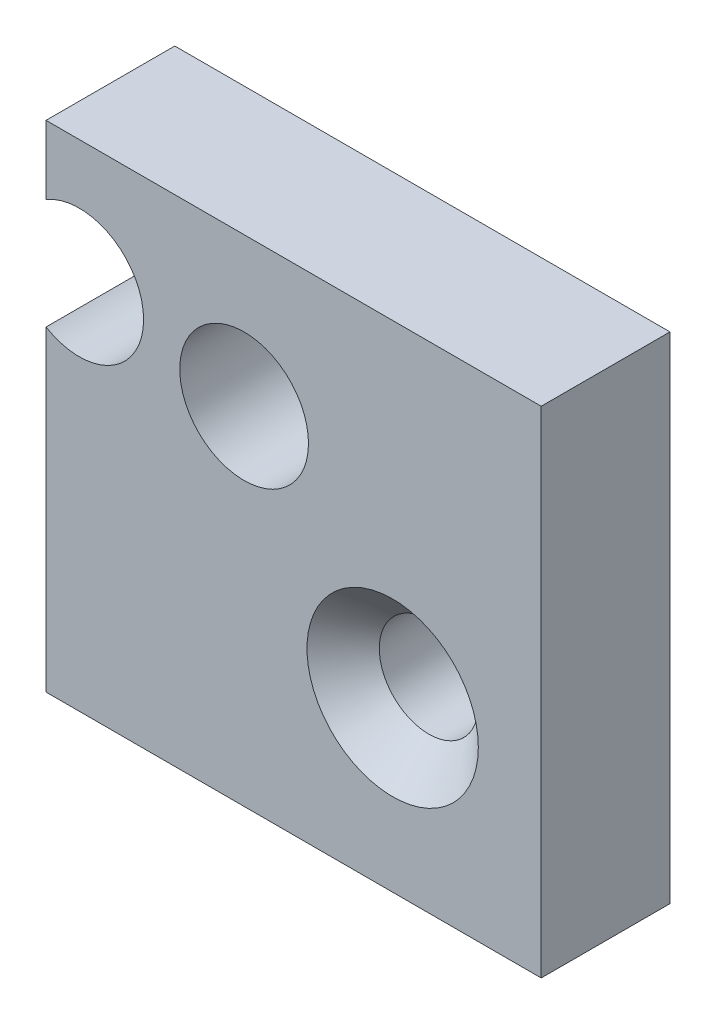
ISO-10303-21;
HEADER;
FILE_DESCRIPTION(('STEP AP214'),'2;1');
FILE_NAME('part.step','',(''),(''),'','','');
FILE_SCHEMA(('AUTOMOTIVE_DESIGN { 1 0 10303 214 1 1 1 1 }'));
ENDSEC;
DATA;
#1=APPLICATION_CONTEXT('core data for automotive mechanical design processes');
#2=APPLICATION_PROTOCOL_DEFINITION('international standard','automotive_design',2000,#1);
#3=PRODUCT_CONTEXT('',#1,'mechanical');
#4=PRODUCT('Part','Part','',(#3));
#5=PRODUCT_RELATED_PRODUCT_CATEGORY('part','',(#4));
#6=PRODUCT_DEFINITION_FORMATION('','',#4);
#7=PRODUCT_DEFINITION_CONTEXT('part definition',#1,'design');
#8=PRODUCT_DEFINITION('design','',#6,#7);
#9=PRODUCT_DEFINITION_SHAPE('','',#8);
#10=(LENGTH_UNIT() NAMED_UNIT(*) SI_UNIT(.MILLI.,.METRE.));
#11=(NAMED_UNIT(*) PLANE_ANGLE_UNIT() SI_UNIT($,.RADIAN.));
#12=(NAMED_UNIT(*) SI_UNIT($,.STERADIAN.) SOLID_ANGLE_UNIT());
#13=UNCERTAINTY_MEASURE_WITH_UNIT(LENGTH_MEASURE(1.E-05),#10,'distance_accuracy_value','');
#14=(GEOMETRIC_REPRESENTATION_CONTEXT(3) GLOBAL_UNCERTAINTY_ASSIGNED_CONTEXT((#13)) GLOBAL_UNIT_ASSIGNED_CONTEXT((#10,
#11,#12)) REPRESENTATION_CONTEXT('',''));
#15=CARTESIAN_POINT('',(0.,0.,0.));
#16=DIRECTION('',(0.,0.,1.));
#17=DIRECTION('',(1.,0.,0.));
#18=AXIS2_PLACEMENT_3D('',#15,#16,#17);
#19=CARTESIAN_POINT('',(-25.,25.,13.));
#20=DIRECTION('',(1.,0.,0.));
#21=DIRECTION('',(0.,1.,0.));
#22=AXIS2_PLACEMENT_3D('',#19,#20,#21);
#23=PLANE('',#22);
#24=DIRECTION('',(0.,-1.,0.));
#25=VECTOR('',#24,1.);
#26=CARTESIAN_POINT('',(-25.,25.,0.));
#27=LINE('',#26,#25);
#28=CARTESIAN_POINT('',(-25.,25.,0.));
#29=VERTEX_POINT('',#28);
#30=CARTESIAN_POINT('',(-25.,18.0706152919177,0.));
#31=VERTEX_POINT('',#30);
#32=EDGE_CURVE('E432',#29,#31,#27,.T.);
#33=ORIENTED_EDGE('',*,*,#32,.T.);
#34=DIRECTION('',(0.,0.,1.));
#35=VECTOR('',#34,1.);
#36=CARTESIAN_POINT('',(-25.,18.0706152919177,13.));
#37=LINE('',#36,#35);
#38=CARTESIAN_POINT('',(-25.,18.0706152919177,13.));
#39=VERTEX_POINT('',#38);
#40=EDGE_CURVE('E377',#31,#39,#37,.T.);
#41=ORIENTED_EDGE('',*,*,#40,.T.);
#42=DIRECTION('',(0.,-1.,0.));
#43=VECTOR('',#42,1.);
#44=CARTESIAN_POINT('',(-25.,25.,13.));
#45=LINE('',#44,#43);
#46=CARTESIAN_POINT('',(-25.,25.,13.));
#47=VERTEX_POINT('',#46);
#48=EDGE_CURVE('E445',#47,#39,#45,.T.);
#49=ORIENTED_EDGE('',*,*,#48,.F.);
#50=DIRECTION('',(0.,0.,-1.));
#51=VECTOR('',#50,1.);
#52=CARTESIAN_POINT('',(-25.,25.,13.));
#53=LINE('',#52,#51);
#54=EDGE_CURVE('E452',#47,#29,#53,.T.);
#55=ORIENTED_EDGE('',*,*,#54,.T.);
#56=EDGE_LOOP('',(#33,#41,#49,#55));
#57=FACE_BOUND('',#56,.T.);
#58=ADVANCED_FACE('F361',(#57),#23,.F.);
#59=CARTESIAN_POINT('',(-25.,6.92938470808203,13.));
#60=VERTEX_POINT('',#59);
#61=CARTESIAN_POINT('',(-25.,-25.,13.));
#62=VERTEX_POINT('',#61);
#63=EDGE_CURVE('E425',#60,#62,#45,.T.);
#64=ORIENTED_EDGE('',*,*,#63,.F.);
#65=DIRECTION('',(0.,0.,1.));
#66=VECTOR('',#65,1.);
#67=CARTESIAN_POINT('',(-25.,6.92938470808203,13.));
#68=LINE('',#67,#66);
#69=CARTESIAN_POINT('',(-25.,6.92938470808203,0.));
#70=VERTEX_POINT('',#69);
#71=EDGE_CURVE('E414',#60,#70,#68,.F.);
#72=ORIENTED_EDGE('',*,*,#71,.T.);
#73=CARTESIAN_POINT('',(-25.,-25.,0.));
#74=VERTEX_POINT('',#73);
#75=EDGE_CURVE('E423',#70,#74,#27,.T.);
#76=ORIENTED_EDGE('',*,*,#75,.T.);
#77=DIRECTION('',(0.,0.,-1.));
#78=VECTOR('',#77,1.);
#79=CARTESIAN_POINT('',(-25.,-25.,13.));
#80=LINE('',#79,#78);
#81=EDGE_CURVE('E365',#62,#74,#80,.T.);
#82=ORIENTED_EDGE('',*,*,#81,.F.);
#83=EDGE_LOOP('',(#64,#72,#76,#82));
#84=FACE_BOUND('',#83,.T.);
#85=ADVANCED_FACE('F363',(#84),#23,.F.);
#86=CARTESIAN_POINT('',(-25.,-25.,13.));
#87=DIRECTION('',(0.,1.,0.));
#88=DIRECTION('',(0.,0.,1.));
#89=AXIS2_PLACEMENT_3D('',#86,#87,#88);
#90=PLANE('',#89);
#91=DIRECTION('',(1.,0.,0.));
#92=VECTOR('',#91,1.);
#93=CARTESIAN_POINT('',(-25.,-25.,0.));
#94=LINE('',#93,#92);
#95=CARTESIAN_POINT('',(25.,-25.,0.));
#96=VERTEX_POINT('',#95);
#97=EDGE_CURVE('E430',#74,#96,#94,.T.);
#98=ORIENTED_EDGE('',*,*,#97,.T.);
#99=DIRECTION('',(0.,0.,-1.));
#100=VECTOR('',#99,1.);
#101=CARTESIAN_POINT('',(25.,-25.,13.));
#102=LINE('',#101,#100);
#103=CARTESIAN_POINT('',(25.,-25.,13.));
#104=VERTEX_POINT('',#103);
#105=EDGE_CURVE('E457',#104,#96,#102,.T.);
#106=ORIENTED_EDGE('',*,*,#105,.F.);
#107=DIRECTION('',(1.,0.,0.));
#108=VECTOR('',#107,1.);
#109=CARTESIAN_POINT('',(-25.,-25.,13.));
#110=LINE('',#109,#108);
#111=EDGE_CURVE('E447',#62,#104,#110,.T.);
#112=ORIENTED_EDGE('',*,*,#111,.F.);
#113=ORIENTED_EDGE('',*,*,#81,.T.);
#114=EDGE_LOOP('',(#98,#106,#112,#113));
#115=FACE_BOUND('',#114,.T.);
#116=ADVANCED_FACE('F464',(#115),#90,.F.);
#117=CARTESIAN_POINT('',(25.,25.,13.));
#118=DIRECTION('',(-1.,0.,0.));
#119=DIRECTION('',(0.,-1.,0.));
#120=AXIS2_PLACEMENT_3D('',#117,#118,#119);
#121=PLANE('',#120);
#122=DIRECTION('',(0.,1.,0.));
#123=VECTOR('',#122,1.);
#124=CARTESIAN_POINT('',(25.,25.,0.));
#125=LINE('',#124,#123);
#126=CARTESIAN_POINT('',(25.,25.,0.));
#127=VERTEX_POINT('',#126);
#128=EDGE_CURVE('E441',#96,#127,#125,.T.);
#129=ORIENTED_EDGE('',*,*,#128,.T.);
#130=DIRECTION('',(0.,0.,-1.));
#131=VECTOR('',#130,1.);
#132=CARTESIAN_POINT('',(25.,25.,13.));
#133=LINE('',#132,#131);
#134=CARTESIAN_POINT('',(25.,25.,13.));
#135=VERTEX_POINT('',#134);
#136=EDGE_CURVE('E455',#135,#127,#133,.T.);
#137=ORIENTED_EDGE('',*,*,#136,.F.);
#138=DIRECTION('',(0.,1.,0.));
#139=VECTOR('',#138,1.);
#140=CARTESIAN_POINT('',(25.,25.,13.));
#141=LINE('',#140,#139);
#142=EDGE_CURVE('E449',#104,#135,#141,.T.);
#143=ORIENTED_EDGE('',*,*,#142,.F.);
#144=ORIENTED_EDGE('',*,*,#105,.T.);
#145=EDGE_LOOP('',(#129,#137,#143,#144));
#146=FACE_BOUND('',#145,.T.);
#147=ADVANCED_FACE('F495',(#146),#121,.F.);
#148=CARTESIAN_POINT('',(-25.,25.,13.));
#149=DIRECTION('',(0.,-1.,0.));
#150=DIRECTION('',(1.,0.,0.));
#151=AXIS2_PLACEMENT_3D('',#148,#149,#150);
#152=PLANE('',#151);
#153=DIRECTION('',(-1.,0.,0.));
#154=VECTOR('',#153,1.);
#155=CARTESIAN_POINT('',(-25.,25.,0.));
#156=LINE('',#155,#154);
#157=EDGE_CURVE('E443',#127,#29,#156,.T.);
#158=ORIENTED_EDGE('',*,*,#157,.T.);
#159=ORIENTED_EDGE('',*,*,#54,.F.);
#160=DIRECTION('',(-1.,0.,0.));
#161=VECTOR('',#160,1.);
#162=CARTESIAN_POINT('',(-25.,25.,13.));
#163=LINE('',#162,#161);
#164=EDGE_CURVE('E384',#135,#47,#163,.T.);
#165=ORIENTED_EDGE('',*,*,#164,.F.);
#166=ORIENTED_EDGE('',*,*,#136,.T.);
#167=EDGE_LOOP('',(#158,#159,#165,#166));
#168=FACE_BOUND('',#167,.T.);
#169=ADVANCED_FACE('F485',(#168),#152,.F.);
#170=CARTESIAN_POINT('',(-25.,25.,13.));
#171=DIRECTION('',(0.,0.,1.));
#172=DIRECTION('',(1.,0.,0.));
#173=AXIS2_PLACEMENT_3D('',#170,#171,#172);
#174=PLANE('',#173);
#175=CARTESIAN_POINT('',(10.,-8.,13.));
#176=DIRECTION('',(0.,0.,1.));
#177=DIRECTION('',(1.,0.,0.));
#178=AXIS2_PLACEMENT_3D('',#175,#176,#177);
#179=CIRCLE('',#178,8.65);
#180=CARTESIAN_POINT('',(18.65,-8.,13.));
#181=VERTEX_POINT('',#180);
#182=EDGE_CURVE('E560',#181,#181,#179,.T.);
#183=ORIENTED_EDGE('',*,*,#182,.F.);
#184=EDGE_LOOP('',(#183));
#185=FACE_BOUND('',#184,.T.);
#186=CARTESIAN_POINT('',(-21.650635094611,12.4999999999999,13.));
#187=DIRECTION('',(0.,0.,1.));
#188=DIRECTION('',(1.,0.,0.));
#189=AXIS2_PLACEMENT_3D('',#186,#187,#188);
#190=CIRCLE('',#189,6.5);
#191=EDGE_CURVE('E426',#60,#39,#190,.T.);
#192=ORIENTED_EDGE('',*,*,#191,.F.);
#193=ORIENTED_EDGE('',*,*,#63,.T.);
#194=ORIENTED_EDGE('',*,*,#111,.T.);
#195=ORIENTED_EDGE('',*,*,#142,.T.);
#196=ORIENTED_EDGE('',*,*,#164,.T.);
#197=ORIENTED_EDGE('',*,*,#48,.T.);
#198=EDGE_LOOP('',(#192,#193,#194,#195,#196,#197));
#199=FACE_BOUND('',#198,.T.);
#200=CARTESIAN_POINT('',(-5.,10.,13.));
#201=DIRECTION('',(0.,0.,1.));
#202=DIRECTION('',(1.,0.,0.));
#203=AXIS2_PLACEMENT_3D('',#200,#201,#202);
#204=CIRCLE('',#203,6.5);
#205=CARTESIAN_POINT('',(1.5,10.,13.));
#206=VERTEX_POINT('',#205);
#207=EDGE_CURVE('E433',#206,#206,#204,.T.);
#208=ORIENTED_EDGE('',*,*,#207,.F.);
#209=EDGE_LOOP('',(#208));
#210=FACE_BOUND('',#209,.T.);
#211=ADVANCED_FACE('F465',(#185,#199,#210),#174,.T.);
#212=CARTESIAN_POINT('',(-25.,25.,0.));
#213=DIRECTION('',(0.,0.,1.));
#214=DIRECTION('',(1.,0.,0.));
#215=AXIS2_PLACEMENT_3D('',#212,#213,#214);
#216=PLANE('',#215);
#217=CARTESIAN_POINT('',(10.,-8.,0.));
#218=DIRECTION('',(0.,0.,1.));
#219=DIRECTION('',(1.,0.,0.));
#220=AXIS2_PLACEMENT_3D('',#217,#218,#219);
#221=CIRCLE('',#220,5.);
#222=CARTESIAN_POINT('',(15.,-8.,0.));
#223=VERTEX_POINT('',#222);
#224=EDGE_CURVE('E469',#223,#223,#221,.T.);
#225=ORIENTED_EDGE('',*,*,#224,.T.);
#226=EDGE_LOOP('',(#225));
#227=FACE_BOUND('',#226,.T.);
#228=CARTESIAN_POINT('',(-5.,10.,0.));
#229=DIRECTION('',(0.,0.,1.));
#230=DIRECTION('',(1.,0.,0.));
#231=AXIS2_PLACEMENT_3D('',#228,#229,#230);
#232=CIRCLE('',#231,6.5);
#233=CARTESIAN_POINT('',(1.49999999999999,10.,0.));
#234=VERTEX_POINT('',#233);
#235=EDGE_CURVE('E436',#234,#234,#232,.T.);
#236=ORIENTED_EDGE('',*,*,#235,.T.);
#237=EDGE_LOOP('',(#236));
#238=FACE_BOUND('',#237,.T.);
#239=ORIENTED_EDGE('',*,*,#75,.F.);
#240=CARTESIAN_POINT('',(-21.650635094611,12.4999999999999,0.));
#241=DIRECTION('',(0.,0.,1.));
#242=DIRECTION('',(1.,0.,0.));
#243=AXIS2_PLACEMENT_3D('',#240,#241,#242);
#244=CIRCLE('',#243,6.5);
#245=EDGE_CURVE('E11',#70,#31,#244,.T.);
#246=ORIENTED_EDGE('',*,*,#245,.T.);
#247=ORIENTED_EDGE('',*,*,#32,.F.);
#248=ORIENTED_EDGE('',*,*,#157,.F.);
#249=ORIENTED_EDGE('',*,*,#128,.F.);
#250=ORIENTED_EDGE('',*,*,#97,.F.);
#251=EDGE_LOOP('',(#239,#246,#247,#248,#249,#250));
#252=FACE_BOUND('',#251,.T.);
#253=ADVANCED_FACE('F428',(#227,#238,#252),#216,.F.);
#254=CARTESIAN_POINT('',(-5.,10.,13.));
#255=DIRECTION('',(0.,0.,1.));
#256=DIRECTION('',(1.,0.,0.));
#257=AXIS2_PLACEMENT_3D('',#254,#255,#256);
#258=CYLINDRICAL_SURFACE('',#257,6.5);
#259=ORIENTED_EDGE('',*,*,#235,.F.);
#260=EDGE_LOOP('',(#259));
#261=FACE_BOUND('',#260,.T.);
#262=ORIENTED_EDGE('',*,*,#207,.T.);
#263=EDGE_LOOP('',(#262));
#264=FACE_BOUND('',#263,.T.);
#265=ADVANCED_FACE('F479',(#261,#264),#258,.F.);
#266=CARTESIAN_POINT('',(-21.650635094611,12.4999999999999,13.));
#267=DIRECTION('',(0.,0.,1.));
#268=DIRECTION('',(1.,0.,0.));
#269=AXIS2_PLACEMENT_3D('',#266,#267,#268);
#270=CYLINDRICAL_SURFACE('',#269,6.5);
#271=ORIENTED_EDGE('',*,*,#245,.F.);
#272=ORIENTED_EDGE('',*,*,#71,.F.);
#273=ORIENTED_EDGE('',*,*,#191,.T.);
#274=ORIENTED_EDGE('',*,*,#40,.F.);
#275=EDGE_LOOP('',(#271,#272,#273,#274));
#276=FACE_BOUND('',#275,.T.);
#277=ADVANCED_FACE('F413',(#276),#270,.F.);
#278=CARTESIAN_POINT('',(10.,-8.,13.));
#279=DIRECTION('',(0.,0.,1.));
#280=DIRECTION('',(1.,0.,0.));
#281=AXIS2_PLACEMENT_3D('',#278,#279,#280);
#282=CYLINDRICAL_SURFACE('',#281,4.99999999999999);
#283=ORIENTED_EDGE('',*,*,#224,.F.);
#284=EDGE_LOOP('',(#283));
#285=FACE_BOUND('',#284,.T.);
#286=CARTESIAN_POINT('',(10.,-8.,9.34999999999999));
#287=DIRECTION('',(0.,0.,1.));
#288=DIRECTION('',(1.,0.,0.));
#289=AXIS2_PLACEMENT_3D('',#286,#287,#288);
#290=CIRCLE('',#289,4.99999999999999);
#291=CARTESIAN_POINT('',(15.,-8.,9.34999999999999));
#292=VERTEX_POINT('',#291);
#293=EDGE_CURVE('E472',#292,#292,#290,.T.);
#294=ORIENTED_EDGE('',*,*,#293,.T.);
#295=EDGE_LOOP('',(#294));
#296=FACE_BOUND('',#295,.T.);
#297=ADVANCED_FACE('F540',(#285,#296),#282,.F.);
#298=CARTESIAN_POINT('',(10.,-8.,13.));
#299=DIRECTION('',(0.,0.,1.));
#300=DIRECTION('',(1.,0.,0.));
#301=AXIS2_PLACEMENT_3D('',#298,#299,#300);
#302=CONICAL_SURFACE('',#301,8.65,0.785398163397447);
#303=ORIENTED_EDGE('',*,*,#293,.F.);
#304=EDGE_LOOP('',(#303));
#305=FACE_BOUND('',#304,.T.);
#306=ORIENTED_EDGE('',*,*,#182,.T.);
#307=EDGE_LOOP('',(#306));
#308=FACE_BOUND('',#307,.T.);
#309=ADVANCED_FACE('F546',(#305,#308),#302,.F.);
#310=CLOSED_SHELL('',(#58,#85,#116,#147,#169,#211,#253,#265,#277,#297,#309));
#311=MANIFOLD_SOLID_BREP('B2',#310);
#312=ADVANCED_BREP_SHAPE_REPRESENTATION('',(#18,#311),#14);
#313=SHAPE_DEFINITION_REPRESENTATION(#9,#312);
ENDSEC;
END-ISO-10303-21;
